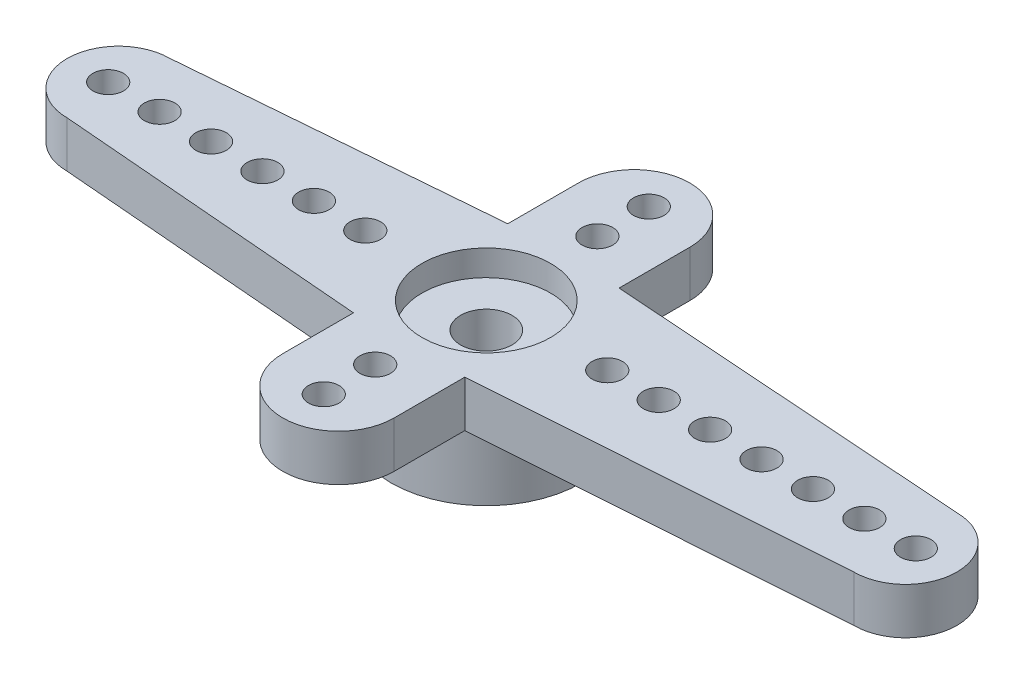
ISO-10303-21;
HEADER;
FILE_DESCRIPTION(('STEP AP214'),'2;1');
FILE_NAME('part.step','',(''),(''),'','','');
FILE_SCHEMA(('AUTOMOTIVE_DESIGN { 1 0 10303 214 1 1 1 1 }'));
ENDSEC;
DATA;
#1=APPLICATION_CONTEXT('core data for automotive mechanical design processes');
#2=APPLICATION_PROTOCOL_DEFINITION('international standard','automotive_design',2000,#1);
#3=PRODUCT_CONTEXT('',#1,'mechanical');
#4=PRODUCT('Part','Part','',(#3));
#5=PRODUCT_RELATED_PRODUCT_CATEGORY('part','',(#4));
#6=PRODUCT_DEFINITION_FORMATION('','',#4);
#7=PRODUCT_DEFINITION_CONTEXT('part definition',#1,'design');
#8=PRODUCT_DEFINITION('design','',#6,#7);
#9=PRODUCT_DEFINITION_SHAPE('','',#8);
#10=(LENGTH_UNIT() NAMED_UNIT(*) SI_UNIT(.MILLI.,.METRE.));
#11=(NAMED_UNIT(*) PLANE_ANGLE_UNIT() SI_UNIT($,.RADIAN.));
#12=(NAMED_UNIT(*) SI_UNIT($,.STERADIAN.) SOLID_ANGLE_UNIT());
#13=UNCERTAINTY_MEASURE_WITH_UNIT(LENGTH_MEASURE(1.E-05),#10,'distance_accuracy_value','');
#14=(GEOMETRIC_REPRESENTATION_CONTEXT(3) GLOBAL_UNCERTAINTY_ASSIGNED_CONTEXT((#13)) GLOBAL_UNIT_ASSIGNED_CONTEXT((#10,
#11,#12)) REPRESENTATION_CONTEXT('',''));
#15=CARTESIAN_POINT('',(0.,0.,0.));
#16=DIRECTION('',(0.,0.,1.));
#17=DIRECTION('',(1.,0.,0.));
#18=AXIS2_PLACEMENT_3D('',#15,#16,#17);
#19=CARTESIAN_POINT('',(0.,4.3,0.));
#20=DIRECTION('',(0.,-1.,0.));
#21=DIRECTION('',(0.,0.,-1.));
#22=AXIS2_PLACEMENT_3D('',#19,#20,#21);
#23=CYLINDRICAL_SURFACE('',#22,3.7);
#24=CARTESIAN_POINT('',(0.,0.,0.));
#25=DIRECTION('',(0.,1.,0.));
#26=DIRECTION('',(0.,0.,1.));
#27=AXIS2_PLACEMENT_3D('',#24,#25,#26);
#28=CIRCLE('',#27,3.7);
#29=CARTESIAN_POINT('',(0.,0.,3.7));
#30=VERTEX_POINT('',#29);
#31=EDGE_CURVE('E333',#30,#30,#28,.T.);
#32=ORIENTED_EDGE('',*,*,#31,.T.);
#33=EDGE_LOOP('',(#32));
#34=FACE_BOUND('',#33,.T.);
#35=CARTESIAN_POINT('',(0.,2.5,0.));
#36=DIRECTION('',(0.,-1.,0.));
#37=DIRECTION('',(0.,0.,-1.));
#38=AXIS2_PLACEMENT_3D('',#35,#36,#37);
#39=CIRCLE('',#38,3.7);
#40=CARTESIAN_POINT('',(2.16564,2.5,-3.00000056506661));
#41=VERTEX_POINT('',#40);
#42=CARTESIAN_POINT('',(2.16564,2.5,3.00000056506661));
#43=VERTEX_POINT('',#42);
#44=EDGE_CURVE('E341',#41,#43,#39,.T.);
#45=ORIENTED_EDGE('',*,*,#44,.T.);
#46=CARTESIAN_POINT('',(0.,2.5,0.));
#47=DIRECTION('',(0.,-1.,0.));
#48=DIRECTION('',(0.,0.,-1.));
#49=AXIS2_PLACEMENT_3D('',#46,#47,#48);
#50=CIRCLE('',#49,3.7);
#51=CARTESIAN_POINT('',(-2.16564,2.5,3.00000056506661));
#52=VERTEX_POINT('',#51);
#53=EDGE_CURVE('E11',#43,#52,#50,.T.);
#54=ORIENTED_EDGE('',*,*,#53,.T.);
#55=CARTESIAN_POINT('',(0.,2.5,0.));
#56=DIRECTION('',(0.,1.,0.));
#57=DIRECTION('',(0.,0.,1.));
#58=AXIS2_PLACEMENT_3D('',#55,#56,#57);
#59=CIRCLE('',#58,3.7);
#60=CARTESIAN_POINT('',(-2.16564,2.5,-3.00000056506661));
#61=VERTEX_POINT('',#60);
#62=EDGE_CURVE('E338',#61,#52,#59,.T.);
#63=ORIENTED_EDGE('',*,*,#62,.F.);
#64=CARTESIAN_POINT('',(0.,2.5,0.));
#65=DIRECTION('',(0.,1.,0.));
#66=DIRECTION('',(0.,0.,1.));
#67=AXIS2_PLACEMENT_3D('',#64,#65,#66);
#68=CIRCLE('',#67,3.7);
#69=EDGE_CURVE('E39',#41,#61,#68,.T.);
#70=ORIENTED_EDGE('',*,*,#69,.F.);
#71=EDGE_LOOP('',(#45,#54,#63,#70));
#72=FACE_BOUND('',#71,.T.);
#73=ADVANCED_FACE('F32',(#34,#72),#23,.T.);
#74=CARTESIAN_POINT('',(0.,4.3,0.));
#75=DIRECTION('',(0.,1.,0.));
#76=DIRECTION('',(0.,0.,1.));
#77=AXIS2_PLACEMENT_3D('',#74,#75,#76);
#78=PLANE('',#77);
#79=DIRECTION('',(0.996621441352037,0.,0.0821322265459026));
#80=VECTOR('',#79,1.);
#81=CARTESIAN_POINT('',(-2.16564,4.3,3.00000056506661));
#82=LINE('',#81,#80);
#83=CARTESIAN_POINT('',(-14.3,4.3,2.));
#84=VERTEX_POINT('',#83);
#85=CARTESIAN_POINT('',(-2.16564,4.3,3.00000056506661));
#86=VERTEX_POINT('',#85);
#87=EDGE_CURVE('E54',#84,#86,#82,.T.);
#88=ORIENTED_EDGE('',*,*,#87,.T.);
#89=DIRECTION('',(0.,0.,1.));
#90=VECTOR('',#89,1.);
#91=CARTESIAN_POINT('',(-2.16564,4.3,3.00000056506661));
#92=LINE('',#91,#90);
#93=CARTESIAN_POINT('',(-2.16564,4.3,5.75000056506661));
#94=VERTEX_POINT('',#93);
#95=EDGE_CURVE('E145',#86,#94,#92,.T.);
#96=ORIENTED_EDGE('',*,*,#95,.T.);
#97=CARTESIAN_POINT('',(0.,4.3,5.75000056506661));
#98=DIRECTION('',(0.,1.,0.));
#99=DIRECTION('',(0.,0.,-1.));
#100=AXIS2_PLACEMENT_3D('',#97,#98,#99);
#101=CIRCLE('',#100,2.16564);
#102=CARTESIAN_POINT('',(2.16564,4.3,5.75000056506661));
#103=VERTEX_POINT('',#102);
#104=EDGE_CURVE('E153',#94,#103,#101,.T.);
#105=ORIENTED_EDGE('',*,*,#104,.T.);
#106=DIRECTION('',(0.,0.,-1.));
#107=VECTOR('',#106,1.);
#108=CARTESIAN_POINT('',(2.16564,4.3,3.00000056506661));
#109=LINE('',#108,#107);
#110=CARTESIAN_POINT('',(2.16564,4.3,3.00000056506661));
#111=VERTEX_POINT('',#110);
#112=EDGE_CURVE('E127',#103,#111,#109,.T.);
#113=ORIENTED_EDGE('',*,*,#112,.T.);
#114=DIRECTION('',(0.99750660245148,0.,-0.070573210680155));
#115=VECTOR('',#114,1.);
#116=CARTESIAN_POINT('',(2.16564,4.3,3.00000056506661));
#117=LINE('',#116,#115);
#118=CARTESIAN_POINT('',(16.3,4.3,2.));
#119=VERTEX_POINT('',#118);
#120=EDGE_CURVE('E266',#111,#119,#117,.T.);
#121=ORIENTED_EDGE('',*,*,#120,.T.);
#122=CARTESIAN_POINT('',(16.3,4.3,0.));
#123=DIRECTION('',(0.,1.,0.));
#124=DIRECTION('',(0.,0.,-1.));
#125=AXIS2_PLACEMENT_3D('',#122,#123,#124);
#126=CIRCLE('',#125,2.);
#127=CARTESIAN_POINT('',(16.3,4.3,-2.));
#128=VERTEX_POINT('',#127);
#129=EDGE_CURVE('E282',#119,#128,#126,.T.);
#130=ORIENTED_EDGE('',*,*,#129,.T.);
#131=DIRECTION('',(-0.99750660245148,0.,-0.0705732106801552));
#132=VECTOR('',#131,1.);
#133=CARTESIAN_POINT('',(2.16564,4.3,-3.00000056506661));
#134=LINE('',#133,#132);
#135=CARTESIAN_POINT('',(2.16564,4.3,-3.00000056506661));
#136=VERTEX_POINT('',#135);
#137=EDGE_CURVE('E273',#128,#136,#134,.T.);
#138=ORIENTED_EDGE('',*,*,#137,.T.);
#139=DIRECTION('',(0.,0.,-1.));
#140=VECTOR('',#139,1.);
#141=CARTESIAN_POINT('',(2.16564,4.3,-3.00000056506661));
#142=LINE('',#141,#140);
#143=CARTESIAN_POINT('',(2.16564,4.3,-5.75000056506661));
#144=VERTEX_POINT('',#143);
#145=EDGE_CURVE('E46',#136,#144,#142,.T.);
#146=ORIENTED_EDGE('',*,*,#145,.T.);
#147=CARTESIAN_POINT('',(0.,4.3,-5.75000056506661));
#148=DIRECTION('',(0.,1.,0.));
#149=DIRECTION('',(0.,0.,1.));
#150=AXIS2_PLACEMENT_3D('',#147,#148,#149);
#151=CIRCLE('',#150,2.16564);
#152=CARTESIAN_POINT('',(-2.16564,4.3,-5.75000056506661));
#153=VERTEX_POINT('',#152);
#154=EDGE_CURVE('E175',#144,#153,#151,.T.);
#155=ORIENTED_EDGE('',*,*,#154,.T.);
#156=DIRECTION('',(0.,0.,1.));
#157=VECTOR('',#156,1.);
#158=CARTESIAN_POINT('',(-2.16564,4.3,-3.00000056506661));
#159=LINE('',#158,#157);
#160=CARTESIAN_POINT('',(-2.16564,4.3,-3.00000056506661));
#161=VERTEX_POINT('',#160);
#162=EDGE_CURVE('E168',#153,#161,#159,.T.);
#163=ORIENTED_EDGE('',*,*,#162,.T.);
#164=DIRECTION('',(-0.996621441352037,0.,0.0821322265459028));
#165=VECTOR('',#164,1.);
#166=CARTESIAN_POINT('',(-2.16564,4.3,-3.00000056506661));
#167=LINE('',#166,#165);
#168=CARTESIAN_POINT('',(-14.3,4.3,-2.));
#169=VERTEX_POINT('',#168);
#170=EDGE_CURVE('E289',#161,#169,#167,.T.);
#171=ORIENTED_EDGE('',*,*,#170,.T.);
#172=CARTESIAN_POINT('',(-14.3,4.3,0.));
#173=DIRECTION('',(0.,1.,0.));
#174=DIRECTION('',(0.,0.,1.));
#175=AXIS2_PLACEMENT_3D('',#172,#173,#174);
#176=CIRCLE('',#175,2.);
#177=EDGE_CURVE('E307',#169,#84,#176,.T.);
#178=ORIENTED_EDGE('',*,*,#177,.T.);
#179=EDGE_LOOP('',(#88,#96,#105,#113,#121,#130,#138,#146,#155,#163,#171,#178));
#180=FACE_BOUND('',#179,.T.);
#181=CARTESIAN_POINT('',(12.705,4.3,0.));
#182=DIRECTION('',(0.,1.,0.));
#183=DIRECTION('',(0.,0.,-1.));
#184=AXIS2_PLACEMENT_3D('',#181,#182,#183);
#185=CIRCLE('',#184,0.595);
#186=CARTESIAN_POINT('',(12.705,4.3,-0.594999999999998));
#187=VERTEX_POINT('',#186);
#188=EDGE_CURVE('E213',#187,#187,#185,.T.);
#189=ORIENTED_EDGE('',*,*,#188,.F.);
#190=EDGE_LOOP('',(#189));
#191=FACE_BOUND('',#190,.T.);
#192=CARTESIAN_POINT('',(10.705,4.3,0.));
#193=DIRECTION('',(0.,1.,0.));
#194=DIRECTION('',(0.,0.,-1.));
#195=AXIS2_PLACEMENT_3D('',#192,#193,#194);
#196=CIRCLE('',#195,0.595);
#197=CARTESIAN_POINT('',(10.705,4.3,-0.594999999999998));
#198=VERTEX_POINT('',#197);
#199=EDGE_CURVE('E219',#198,#198,#196,.T.);
#200=ORIENTED_EDGE('',*,*,#199,.F.);
#201=EDGE_LOOP('',(#200));
#202=FACE_BOUND('',#201,.T.);
#203=CARTESIAN_POINT('',(8.705,4.3,0.));
#204=DIRECTION('',(0.,1.,0.));
#205=DIRECTION('',(0.,0.,-1.));
#206=AXIS2_PLACEMENT_3D('',#203,#204,#205);
#207=CIRCLE('',#206,0.595);
#208=CARTESIAN_POINT('',(8.705,4.3,-0.594999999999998));
#209=VERTEX_POINT('',#208);
#210=EDGE_CURVE('E206',#209,#209,#207,.T.);
#211=ORIENTED_EDGE('',*,*,#210,.F.);
#212=EDGE_LOOP('',(#211));
#213=FACE_BOUND('',#212,.T.);
#214=CARTESIAN_POINT('',(16.705,4.3,0.));
#215=DIRECTION('',(0.,1.,0.));
#216=DIRECTION('',(0.,0.,-1.));
#217=AXIS2_PLACEMENT_3D('',#214,#215,#216);
#218=CIRCLE('',#217,0.594999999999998);
#219=CARTESIAN_POINT('',(16.705,4.3,-0.594999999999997));
#220=VERTEX_POINT('',#219);
#221=EDGE_CURVE('E189',#220,#220,#218,.T.);
#222=ORIENTED_EDGE('',*,*,#221,.F.);
#223=EDGE_LOOP('',(#222));
#224=FACE_BOUND('',#223,.T.);
#225=CARTESIAN_POINT('',(4.705,4.3,0.));
#226=DIRECTION('',(0.,1.,0.));
#227=DIRECTION('',(0.,0.,-1.));
#228=AXIS2_PLACEMENT_3D('',#225,#226,#227);
#229=CIRCLE('',#228,0.595);
#230=CARTESIAN_POINT('',(4.705,4.3,-0.594999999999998));
#231=VERTEX_POINT('',#230);
#232=EDGE_CURVE('E195',#231,#231,#229,.T.);
#233=ORIENTED_EDGE('',*,*,#232,.F.);
#234=EDGE_LOOP('',(#233));
#235=FACE_BOUND('',#234,.T.);
#236=CARTESIAN_POINT('',(6.705,4.3,0.));
#237=DIRECTION('',(0.,1.,0.));
#238=DIRECTION('',(0.,0.,-1.));
#239=AXIS2_PLACEMENT_3D('',#236,#237,#238);
#240=CIRCLE('',#239,0.595);
#241=CARTESIAN_POINT('',(6.705,4.3,-0.594999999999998));
#242=VERTEX_POINT('',#241);
#243=EDGE_CURVE('E194',#242,#242,#240,.T.);
#244=ORIENTED_EDGE('',*,*,#243,.F.);
#245=EDGE_LOOP('',(#244));
#246=FACE_BOUND('',#245,.T.);
#247=CARTESIAN_POINT('',(14.705,4.3,0.));
#248=DIRECTION('',(0.,1.,0.));
#249=DIRECTION('',(0.,0.,-1.));
#250=AXIS2_PLACEMENT_3D('',#247,#248,#249);
#251=CIRCLE('',#250,0.595);
#252=CARTESIAN_POINT('',(14.705,4.3,-0.594999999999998));
#253=VERTEX_POINT('',#252);
#254=EDGE_CURVE('E212',#253,#253,#251,.T.);
#255=ORIENTED_EDGE('',*,*,#254,.F.);
#256=EDGE_LOOP('',(#255));
#257=FACE_BOUND('',#256,.T.);
#258=CARTESIAN_POINT('',(-4.705,4.3,0.));
#259=DIRECTION('',(0.,1.,0.));
#260=DIRECTION('',(0.,0.,1.));
#261=AXIS2_PLACEMENT_3D('',#258,#259,#260);
#262=CIRCLE('',#261,0.595);
#263=CARTESIAN_POINT('',(-4.705,4.3,0.595000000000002));
#264=VERTEX_POINT('',#263);
#265=EDGE_CURVE('E255',#264,#264,#262,.T.);
#266=ORIENTED_EDGE('',*,*,#265,.F.);
#267=EDGE_LOOP('',(#266));
#268=FACE_BOUND('',#267,.T.);
#269=CARTESIAN_POINT('',(-6.705,4.3,0.));
#270=DIRECTION('',(0.,1.,0.));
#271=DIRECTION('',(0.,0.,1.));
#272=AXIS2_PLACEMENT_3D('',#269,#270,#271);
#273=CIRCLE('',#272,0.595);
#274=CARTESIAN_POINT('',(-6.705,4.3,0.595000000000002));
#275=VERTEX_POINT('',#274);
#276=EDGE_CURVE('E249',#275,#275,#273,.T.);
#277=ORIENTED_EDGE('',*,*,#276,.F.);
#278=EDGE_LOOP('',(#277));
#279=FACE_BOUND('',#278,.T.);
#280=CARTESIAN_POINT('',(-8.705,4.3,0.));
#281=DIRECTION('',(0.,1.,0.));
#282=DIRECTION('',(0.,0.,1.));
#283=AXIS2_PLACEMENT_3D('',#280,#281,#282);
#284=CIRCLE('',#283,0.595);
#285=CARTESIAN_POINT('',(-8.705,4.3,0.595000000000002));
#286=VERTEX_POINT('',#285);
#287=EDGE_CURVE('E243',#286,#286,#284,.T.);
#288=ORIENTED_EDGE('',*,*,#287,.F.);
#289=EDGE_LOOP('',(#288));
#290=FACE_BOUND('',#289,.T.);
#291=CARTESIAN_POINT('',(-10.705,4.3,0.));
#292=DIRECTION('',(0.,1.,0.));
#293=DIRECTION('',(0.,0.,1.));
#294=AXIS2_PLACEMENT_3D('',#291,#292,#293);
#295=CIRCLE('',#294,0.595);
#296=CARTESIAN_POINT('',(-10.705,4.3,0.595000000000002));
#297=VERTEX_POINT('',#296);
#298=EDGE_CURVE('E237',#297,#297,#295,.T.);
#299=ORIENTED_EDGE('',*,*,#298,.F.);
#300=EDGE_LOOP('',(#299));
#301=FACE_BOUND('',#300,.T.);
#302=CARTESIAN_POINT('',(-12.705,4.3,0.));
#303=DIRECTION('',(0.,1.,0.));
#304=DIRECTION('',(0.,0.,1.));
#305=AXIS2_PLACEMENT_3D('',#302,#303,#304);
#306=CIRCLE('',#305,0.595);
#307=CARTESIAN_POINT('',(-12.705,4.3,0.595000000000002));
#308=VERTEX_POINT('',#307);
#309=EDGE_CURVE('E231',#308,#308,#306,.T.);
#310=ORIENTED_EDGE('',*,*,#309,.F.);
#311=EDGE_LOOP('',(#310));
#312=FACE_BOUND('',#311,.T.);
#313=CARTESIAN_POINT('',(-14.705,4.3,0.));
#314=DIRECTION('',(0.,1.,0.));
#315=DIRECTION('',(0.,0.,1.));
#316=AXIS2_PLACEMENT_3D('',#313,#314,#315);
#317=CIRCLE('',#316,0.595);
#318=CARTESIAN_POINT('',(-14.705,4.3,0.595000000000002));
#319=VERTEX_POINT('',#318);
#320=EDGE_CURVE('E230',#319,#319,#317,.T.);
#321=ORIENTED_EDGE('',*,*,#320,.F.);
#322=EDGE_LOOP('',(#321));
#323=FACE_BOUND('',#322,.T.);
#324=CARTESIAN_POINT('',(0.,4.3,0.));
#325=DIRECTION('',(0.,1.,0.));
#326=DIRECTION('',(0.,0.,1.));
#327=AXIS2_PLACEMENT_3D('',#324,#325,#326);
#328=CIRCLE('',#327,2.5);
#329=CARTESIAN_POINT('',(0.,4.3,2.5));
#330=VERTEX_POINT('',#329);
#331=EDGE_CURVE('E321',#330,#330,#328,.T.);
#332=ORIENTED_EDGE('',*,*,#331,.F.);
#333=EDGE_LOOP('',(#332));
#334=FACE_BOUND('',#333,.T.);
#335=CARTESIAN_POINT('',(0.,4.3,-4.32064056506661));
#336=DIRECTION('',(0.,1.,0.));
#337=DIRECTION('',(0.,0.,1.));
#338=AXIS2_PLACEMENT_3D('',#335,#336,#337);
#339=CIRCLE('',#338,0.595);
#340=CARTESIAN_POINT('',(0.,4.3,-3.72564056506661));
#341=VERTEX_POINT('',#340);
#342=EDGE_CURVE('E157',#341,#341,#339,.T.);
#343=ORIENTED_EDGE('',*,*,#342,.F.);
#344=EDGE_LOOP('',(#343));
#345=FACE_BOUND('',#344,.T.);
#346=CARTESIAN_POINT('',(0.,4.3,-6.32064056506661));
#347=DIRECTION('',(0.,1.,0.));
#348=DIRECTION('',(0.,0.,1.));
#349=AXIS2_PLACEMENT_3D('',#346,#347,#348);
#350=CIRCLE('',#349,0.595);
#351=CARTESIAN_POINT('',(0.,4.3,-5.72564056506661));
#352=VERTEX_POINT('',#351);
#353=EDGE_CURVE('E162',#352,#352,#350,.T.);
#354=ORIENTED_EDGE('',*,*,#353,.F.);
#355=EDGE_LOOP('',(#354));
#356=FACE_BOUND('',#355,.T.);
#357=CARTESIAN_POINT('',(0.,4.3,6.32064056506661));
#358=DIRECTION('',(0.,1.,0.));
#359=DIRECTION('',(0.,0.,-1.));
#360=AXIS2_PLACEMENT_3D('',#357,#358,#359);
#361=CIRCLE('',#360,0.595);
#362=CARTESIAN_POINT('',(0.,4.3,5.72564056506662));
#363=VERTEX_POINT('',#362);
#364=EDGE_CURVE('E608',#363,#363,#361,.T.);
#365=ORIENTED_EDGE('',*,*,#364,.F.);
#366=EDGE_LOOP('',(#365));
#367=FACE_BOUND('',#366,.T.);
#368=CARTESIAN_POINT('',(0.,4.3,4.32064056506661));
#369=DIRECTION('',(0.,1.,0.));
#370=DIRECTION('',(0.,0.,-1.));
#371=AXIS2_PLACEMENT_3D('',#368,#369,#370);
#372=CIRCLE('',#371,0.595);
#373=CARTESIAN_POINT('',(0.,4.3,3.72564056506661));
#374=VERTEX_POINT('',#373);
#375=EDGE_CURVE('E149',#374,#374,#372,.T.);
#376=ORIENTED_EDGE('',*,*,#375,.F.);
#377=EDGE_LOOP('',(#376));
#378=FACE_BOUND('',#377,.T.);
#379=ADVANCED_FACE('F377',(#180,#191,#202,#213,#224,#235,#246,#257,#268,#279,#290,#301,#312,
#323,#334,#345,#356,#367,#378),#78,.T.);
#380=CARTESIAN_POINT('',(0.,0.,0.));
#381=DIRECTION('',(0.,1.,0.));
#382=DIRECTION('',(0.,0.,1.));
#383=AXIS2_PLACEMENT_3D('',#380,#381,#382);
#384=PLANE('',#383);
#385=CARTESIAN_POINT('',(0.,0.,0.));
#386=DIRECTION('',(0.,-1.,0.));
#387=DIRECTION('',(0.,0.,-1.));
#388=AXIS2_PLACEMENT_3D('',#385,#386,#387);
#389=CIRCLE('',#388,2.5);
#390=CARTESIAN_POINT('',(0.,0.,-2.5));
#391=VERTEX_POINT('',#390);
#392=EDGE_CURVE('E327',#391,#391,#389,.T.);
#393=ORIENTED_EDGE('',*,*,#392,.F.);
#394=EDGE_LOOP('',(#393));
#395=FACE_BOUND('',#394,.T.);
#396=ORIENTED_EDGE('',*,*,#31,.F.);
#397=EDGE_LOOP('',(#396));
#398=FACE_BOUND('',#397,.T.);
#399=ADVANCED_FACE('F408',(#395,#398),#384,.F.);
#400=CARTESIAN_POINT('',(0.,1.5,0.));
#401=DIRECTION('',(0.,-1.,0.));
#402=DIRECTION('',(0.,0.,-1.));
#403=AXIS2_PLACEMENT_3D('',#400,#401,#402);
#404=CYLINDRICAL_SURFACE('',#403,2.5);
#405=CARTESIAN_POINT('',(0.,1.5,0.));
#406=DIRECTION('',(0.,-1.,0.));
#407=DIRECTION('',(0.,0.,-1.));
#408=AXIS2_PLACEMENT_3D('',#405,#406,#407);
#409=CIRCLE('',#408,2.5);
#410=CARTESIAN_POINT('',(0.,1.5,-2.5));
#411=VERTEX_POINT('',#410);
#412=EDGE_CURVE('E330',#411,#411,#409,.T.);
#413=ORIENTED_EDGE('',*,*,#412,.F.);
#414=EDGE_LOOP('',(#413));
#415=FACE_BOUND('',#414,.T.);
#416=ORIENTED_EDGE('',*,*,#392,.T.);
#417=EDGE_LOOP('',(#416));
#418=FACE_BOUND('',#417,.T.);
#419=ADVANCED_FACE('F413',(#415,#418),#404,.F.);
#420=CARTESIAN_POINT('',(0.,1.5,0.));
#421=DIRECTION('',(0.,-1.,0.));
#422=DIRECTION('',(0.,0.,-1.));
#423=AXIS2_PLACEMENT_3D('',#420,#421,#422);
#424=PLANE('',#423);
#425=CARTESIAN_POINT('',(0.,1.5,0.));
#426=DIRECTION('',(0.,1.,0.));
#427=DIRECTION('',(0.,0.,1.));
#428=AXIS2_PLACEMENT_3D('',#425,#426,#427);
#429=CIRCLE('',#428,1.);
#430=CARTESIAN_POINT('',(0.,1.5,1.));
#431=VERTEX_POINT('',#430);
#432=EDGE_CURVE('E318',#431,#431,#429,.T.);
#433=ORIENTED_EDGE('',*,*,#432,.T.);
#434=EDGE_LOOP('',(#433));
#435=FACE_BOUND('',#434,.T.);
#436=ORIENTED_EDGE('',*,*,#412,.T.);
#437=EDGE_LOOP('',(#436));
#438=FACE_BOUND('',#437,.T.);
#439=ADVANCED_FACE('F418',(#435,#438),#424,.T.);
#440=CARTESIAN_POINT('',(0.,3.3,0.));
#441=DIRECTION('',(0.,1.,0.));
#442=DIRECTION('',(0.,0.,1.));
#443=AXIS2_PLACEMENT_3D('',#440,#441,#442);
#444=CYLINDRICAL_SURFACE('',#443,2.5);
#445=CARTESIAN_POINT('',(0.,3.3,0.));
#446=DIRECTION('',(0.,1.,0.));
#447=DIRECTION('',(0.,0.,1.));
#448=AXIS2_PLACEMENT_3D('',#445,#446,#447);
#449=CIRCLE('',#448,2.5);
#450=CARTESIAN_POINT('',(0.,3.3,2.5));
#451=VERTEX_POINT('',#450);
#452=EDGE_CURVE('E324',#451,#451,#449,.T.);
#453=ORIENTED_EDGE('',*,*,#452,.F.);
#454=EDGE_LOOP('',(#453));
#455=FACE_BOUND('',#454,.T.);
#456=ORIENTED_EDGE('',*,*,#331,.T.);
#457=EDGE_LOOP('',(#456));
#458=FACE_BOUND('',#457,.T.);
#459=ADVANCED_FACE('F425',(#455,#458),#444,.F.);
#460=CARTESIAN_POINT('',(0.,3.3,0.));
#461=DIRECTION('',(0.,1.,0.));
#462=DIRECTION('',(0.,0.,1.));
#463=AXIS2_PLACEMENT_3D('',#460,#461,#462);
#464=PLANE('',#463);
#465=CARTESIAN_POINT('',(0.,3.3,0.));
#466=DIRECTION('',(0.,1.,0.));
#467=DIRECTION('',(0.,0.,1.));
#468=AXIS2_PLACEMENT_3D('',#465,#466,#467);
#469=CIRCLE('',#468,1.);
#470=CARTESIAN_POINT('',(0.,3.3,1.));
#471=VERTEX_POINT('',#470);
#472=EDGE_CURVE('E312',#471,#471,#469,.T.);
#473=ORIENTED_EDGE('',*,*,#472,.F.);
#474=EDGE_LOOP('',(#473));
#475=FACE_BOUND('',#474,.T.);
#476=ORIENTED_EDGE('',*,*,#452,.T.);
#477=EDGE_LOOP('',(#476));
#478=FACE_BOUND('',#477,.T.);
#479=ADVANCED_FACE('F429',(#475,#478),#464,.T.);
#480=CARTESIAN_POINT('',(0.,1.5,0.));
#481=DIRECTION('',(0.,1.,0.));
#482=DIRECTION('',(0.,0.,1.));
#483=AXIS2_PLACEMENT_3D('',#480,#481,#482);
#484=CYLINDRICAL_SURFACE('',#483,1.);
#485=ORIENTED_EDGE('',*,*,#432,.F.);
#486=EDGE_LOOP('',(#485));
#487=FACE_BOUND('',#486,.T.);
#488=ORIENTED_EDGE('',*,*,#472,.T.);
#489=EDGE_LOOP('',(#488));
#490=FACE_BOUND('',#489,.T.);
#491=ADVANCED_FACE('F433',(#487,#490),#484,.F.);
#492=CARTESIAN_POINT('',(-2.16564,2.5,-3.00000056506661));
#493=DIRECTION('',(-0.0821322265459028,0.,-0.996621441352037));
#494=DIRECTION('',(-0.996621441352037,0.,0.0821322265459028));
#495=AXIS2_PLACEMENT_3D('',#492,#493,#494);
#496=PLANE('',#495);
#497=ORIENTED_EDGE('',*,*,#170,.F.);
#498=DIRECTION('',(0.,1.,0.));
#499=VECTOR('',#498,1.);
#500=CARTESIAN_POINT('',(-2.16564,2.5,-3.00000056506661));
#501=LINE('',#500,#499);
#502=EDGE_CURVE('E310',#61,#161,#501,.T.);
#503=ORIENTED_EDGE('',*,*,#502,.F.);
#504=DIRECTION('',(-0.996621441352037,0.,0.0821322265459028));
#505=VECTOR('',#504,1.);
#506=CARTESIAN_POINT('',(-2.16564,2.5,-3.00000056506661));
#507=LINE('',#506,#505);
#508=CARTESIAN_POINT('',(-14.3,2.5,-2.));
#509=VERTEX_POINT('',#508);
#510=EDGE_CURVE('E295',#61,#509,#507,.T.);
#511=ORIENTED_EDGE('',*,*,#510,.T.);
#512=DIRECTION('',(0.,1.,0.));
#513=VECTOR('',#512,1.);
#514=CARTESIAN_POINT('',(-14.3,2.5,-2.));
#515=LINE('',#514,#513);
#516=EDGE_CURVE('E304',#509,#169,#515,.T.);
#517=ORIENTED_EDGE('',*,*,#516,.T.);
#518=EDGE_LOOP('',(#497,#503,#511,#517));
#519=FACE_BOUND('',#518,.T.);
#520=ADVANCED_FACE('F359',(#519),#496,.T.);
#521=CARTESIAN_POINT('',(-2.16564,2.5,3.00000056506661));
#522=DIRECTION('',(-0.0821322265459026,0.,0.996621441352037));
#523=DIRECTION('',(0.996621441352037,0.,0.0821322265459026));
#524=AXIS2_PLACEMENT_3D('',#521,#522,#523);
#525=PLANE('',#524);
#526=ORIENTED_EDGE('',*,*,#87,.F.);
#527=DIRECTION('',(0.,1.,0.));
#528=VECTOR('',#527,1.);
#529=CARTESIAN_POINT('',(-14.3,2.5,2.));
#530=LINE('',#529,#528);
#531=CARTESIAN_POINT('',(-14.3,2.5,2.));
#532=VERTEX_POINT('',#531);
#533=EDGE_CURVE('E315',#532,#84,#530,.T.);
#534=ORIENTED_EDGE('',*,*,#533,.F.);
#535=DIRECTION('',(0.996621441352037,0.,0.0821322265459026));
#536=VECTOR('',#535,1.);
#537=CARTESIAN_POINT('',(-2.16564,2.5,3.00000056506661));
#538=LINE('',#537,#536);
#539=EDGE_CURVE('E301',#532,#52,#538,.T.);
#540=ORIENTED_EDGE('',*,*,#539,.T.);
#541=DIRECTION('',(0.,1.,0.));
#542=VECTOR('',#541,1.);
#543=CARTESIAN_POINT('',(-2.16564,2.5,3.00000056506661));
#544=LINE('',#543,#542);
#545=EDGE_CURVE('E313',#52,#86,#544,.T.);
#546=ORIENTED_EDGE('',*,*,#545,.T.);
#547=EDGE_LOOP('',(#526,#534,#540,#546));
#548=FACE_BOUND('',#547,.T.);
#549=ADVANCED_FACE('F384',(#548),#525,.T.);
#550=CARTESIAN_POINT('',(-14.3,2.5,0.));
#551=DIRECTION('',(0.,1.,0.));
#552=DIRECTION('',(0.,0.,1.));
#553=AXIS2_PLACEMENT_3D('',#550,#551,#552);
#554=CYLINDRICAL_SURFACE('',#553,2.);
#555=ORIENTED_EDGE('',*,*,#177,.F.);
#556=ORIENTED_EDGE('',*,*,#516,.F.);
#557=CARTESIAN_POINT('',(-14.3,2.5,0.));
#558=DIRECTION('',(0.,1.,0.));
#559=DIRECTION('',(0.,0.,1.));
#560=AXIS2_PLACEMENT_3D('',#557,#558,#559);
#561=CIRCLE('',#560,2.);
#562=EDGE_CURVE('E298',#509,#532,#561,.T.);
#563=ORIENTED_EDGE('',*,*,#562,.T.);
#564=ORIENTED_EDGE('',*,*,#533,.T.);
#565=EDGE_LOOP('',(#555,#556,#563,#564));
#566=FACE_BOUND('',#565,.T.);
#567=ADVANCED_FACE('F387',(#566),#554,.T.);
#568=CARTESIAN_POINT('',(-14.3,2.5,0.));
#569=DIRECTION('',(0.,1.,0.));
#570=DIRECTION('',(0.,0.,1.));
#571=AXIS2_PLACEMENT_3D('',#568,#569,#570);
#572=PLANE('',#571);
#573=CARTESIAN_POINT('',(-4.705,2.5,0.));
#574=DIRECTION('',(0.,1.,0.));
#575=DIRECTION('',(0.,0.,1.));
#576=AXIS2_PLACEMENT_3D('',#573,#574,#575);
#577=CIRCLE('',#576,0.595);
#578=CARTESIAN_POINT('',(-4.705,2.5,0.595000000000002));
#579=VERTEX_POINT('',#578);
#580=EDGE_CURVE('E252',#579,#579,#577,.T.);
#581=ORIENTED_EDGE('',*,*,#580,.T.);
#582=EDGE_LOOP('',(#581));
#583=FACE_BOUND('',#582,.T.);
#584=CARTESIAN_POINT('',(-6.705,2.5,0.));
#585=DIRECTION('',(0.,1.,0.));
#586=DIRECTION('',(0.,0.,1.));
#587=AXIS2_PLACEMENT_3D('',#584,#585,#586);
#588=CIRCLE('',#587,0.595);
#589=CARTESIAN_POINT('',(-6.705,2.5,0.595000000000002));
#590=VERTEX_POINT('',#589);
#591=EDGE_CURVE('E246',#590,#590,#588,.T.);
#592=ORIENTED_EDGE('',*,*,#591,.T.);
#593=EDGE_LOOP('',(#592));
#594=FACE_BOUND('',#593,.T.);
#595=CARTESIAN_POINT('',(-8.705,2.5,0.));
#596=DIRECTION('',(0.,1.,0.));
#597=DIRECTION('',(0.,0.,1.));
#598=AXIS2_PLACEMENT_3D('',#595,#596,#597);
#599=CIRCLE('',#598,0.595);
#600=CARTESIAN_POINT('',(-8.705,2.5,0.595000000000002));
#601=VERTEX_POINT('',#600);
#602=EDGE_CURVE('E240',#601,#601,#599,.T.);
#603=ORIENTED_EDGE('',*,*,#602,.T.);
#604=EDGE_LOOP('',(#603));
#605=FACE_BOUND('',#604,.T.);
#606=CARTESIAN_POINT('',(-10.705,2.5,0.));
#607=DIRECTION('',(0.,1.,0.));
#608=DIRECTION('',(0.,0.,1.));
#609=AXIS2_PLACEMENT_3D('',#606,#607,#608);
#610=CIRCLE('',#609,0.595);
#611=CARTESIAN_POINT('',(-10.705,2.5,0.595000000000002));
#612=VERTEX_POINT('',#611);
#613=EDGE_CURVE('E234',#612,#612,#610,.T.);
#614=ORIENTED_EDGE('',*,*,#613,.T.);
#615=EDGE_LOOP('',(#614));
#616=FACE_BOUND('',#615,.T.);
#617=CARTESIAN_POINT('',(-12.705,2.5,0.));
#618=DIRECTION('',(0.,1.,0.));
#619=DIRECTION('',(0.,0.,1.));
#620=AXIS2_PLACEMENT_3D('',#617,#618,#619);
#621=CIRCLE('',#620,0.595);
#622=CARTESIAN_POINT('',(-12.705,2.5,0.595000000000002));
#623=VERTEX_POINT('',#622);
#624=EDGE_CURVE('E227',#623,#623,#621,.T.);
#625=ORIENTED_EDGE('',*,*,#624,.T.);
#626=EDGE_LOOP('',(#625));
#627=FACE_BOUND('',#626,.T.);
#628=CARTESIAN_POINT('',(-14.705,2.5,0.));
#629=DIRECTION('',(0.,1.,0.));
#630=DIRECTION('',(0.,0.,1.));
#631=AXIS2_PLACEMENT_3D('',#628,#629,#630);
#632=CIRCLE('',#631,0.595);
#633=CARTESIAN_POINT('',(-14.705,2.5,0.595000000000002));
#634=VERTEX_POINT('',#633);
#635=EDGE_CURVE('E263',#634,#634,#632,.T.);
#636=ORIENTED_EDGE('',*,*,#635,.T.);
#637=EDGE_LOOP('',(#636));
#638=FACE_BOUND('',#637,.T.);
#639=ORIENTED_EDGE('',*,*,#510,.F.);
#640=ORIENTED_EDGE('',*,*,#62,.T.);
#641=ORIENTED_EDGE('',*,*,#539,.F.);
#642=ORIENTED_EDGE('',*,*,#562,.F.);
#643=EDGE_LOOP('',(#639,#640,#641,#642));
#644=FACE_BOUND('',#643,.T.);
#645=ADVANCED_FACE('F362',(#583,#594,#605,#616,#627,#638,#644),#572,.F.);
#646=CARTESIAN_POINT('',(2.16564,2.5,-3.00000056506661));
#647=DIRECTION('',(0.0705732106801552,0.,-0.99750660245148));
#648=DIRECTION('',(-0.99750660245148,0.,-0.0705732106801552));
#649=AXIS2_PLACEMENT_3D('',#646,#647,#648);
#650=PLANE('',#649);
#651=ORIENTED_EDGE('',*,*,#137,.F.);
#652=DIRECTION('',(0.,1.,0.));
#653=VECTOR('',#652,1.);
#654=CARTESIAN_POINT('',(16.3,2.5,-2.));
#655=LINE('',#654,#653);
#656=CARTESIAN_POINT('',(16.3,2.5,-2.));
#657=VERTEX_POINT('',#656);
#658=EDGE_CURVE('E290',#657,#128,#655,.T.);
#659=ORIENTED_EDGE('',*,*,#658,.F.);
#660=DIRECTION('',(-0.99750660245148,0.,-0.0705732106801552));
#661=VECTOR('',#660,1.);
#662=CARTESIAN_POINT('',(2.16564,2.5,-3.00000056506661));
#663=LINE('',#662,#661);
#664=EDGE_CURVE('E276',#657,#41,#663,.T.);
#665=ORIENTED_EDGE('',*,*,#664,.T.);
#666=DIRECTION('',(0.,1.,0.));
#667=VECTOR('',#666,1.);
#668=CARTESIAN_POINT('',(2.16564,2.5,-3.00000056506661));
#669=LINE('',#668,#667);
#670=EDGE_CURVE('E286',#41,#136,#669,.T.);
#671=ORIENTED_EDGE('',*,*,#670,.T.);
#672=EDGE_LOOP('',(#651,#659,#665,#671));
#673=FACE_BOUND('',#672,.T.);
#674=ADVANCED_FACE('F371',(#673),#650,.T.);
#675=CARTESIAN_POINT('',(16.3,2.5,0.));
#676=DIRECTION('',(0.,1.,0.));
#677=DIRECTION('',(0.,0.,1.));
#678=AXIS2_PLACEMENT_3D('',#675,#676,#677);
#679=CYLINDRICAL_SURFACE('',#678,2.);
#680=ORIENTED_EDGE('',*,*,#129,.F.);
#681=DIRECTION('',(0.,1.,0.));
#682=VECTOR('',#681,1.);
#683=CARTESIAN_POINT('',(16.3,2.5,2.));
#684=LINE('',#683,#682);
#685=CARTESIAN_POINT('',(16.3,2.5,2.));
#686=VERTEX_POINT('',#685);
#687=EDGE_CURVE('E292',#686,#119,#684,.T.);
#688=ORIENTED_EDGE('',*,*,#687,.F.);
#689=CARTESIAN_POINT('',(16.3,2.5,0.));
#690=DIRECTION('',(0.,1.,0.));
#691=DIRECTION('',(0.,0.,-1.));
#692=AXIS2_PLACEMENT_3D('',#689,#690,#691);
#693=CIRCLE('',#692,2.);
#694=EDGE_CURVE('E272',#686,#657,#693,.T.);
#695=ORIENTED_EDGE('',*,*,#694,.T.);
#696=ORIENTED_EDGE('',*,*,#658,.T.);
#697=EDGE_LOOP('',(#680,#688,#695,#696));
#698=FACE_BOUND('',#697,.T.);
#699=ADVANCED_FACE('F374',(#698),#679,.T.);
#700=CARTESIAN_POINT('',(2.16564,2.5,3.00000056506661));
#701=DIRECTION('',(0.070573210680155,0.,0.99750660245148));
#702=DIRECTION('',(0.99750660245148,0.,-0.070573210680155));
#703=AXIS2_PLACEMENT_3D('',#700,#701,#702);
#704=PLANE('',#703);
#705=ORIENTED_EDGE('',*,*,#120,.F.);
#706=DIRECTION('',(0.,1.,0.));
#707=VECTOR('',#706,1.);
#708=CARTESIAN_POINT('',(2.16564,2.5,3.00000056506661));
#709=LINE('',#708,#707);
#710=EDGE_CURVE('E279',#43,#111,#709,.T.);
#711=ORIENTED_EDGE('',*,*,#710,.F.);
#712=DIRECTION('',(0.99750660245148,0.,-0.070573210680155));
#713=VECTOR('',#712,1.);
#714=CARTESIAN_POINT('',(2.16564,2.5,3.00000056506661));
#715=LINE('',#714,#713);
#716=EDGE_CURVE('E269',#43,#686,#715,.T.);
#717=ORIENTED_EDGE('',*,*,#716,.T.);
#718=ORIENTED_EDGE('',*,*,#687,.T.);
#719=EDGE_LOOP('',(#705,#711,#717,#718));
#720=FACE_BOUND('',#719,.T.);
#721=ADVANCED_FACE('F376',(#720),#704,.T.);
#722=CARTESIAN_POINT('',(16.3,2.5,0.));
#723=DIRECTION('',(0.,-1.,0.));
#724=DIRECTION('',(0.,0.,-1.));
#725=AXIS2_PLACEMENT_3D('',#722,#723,#724);
#726=PLANE('',#725);
#727=CARTESIAN_POINT('',(12.705,2.5,0.));
#728=DIRECTION('',(0.,1.,0.));
#729=DIRECTION('',(0.,0.,-1.));
#730=AXIS2_PLACEMENT_3D('',#727,#728,#729);
#731=CIRCLE('',#730,0.595);
#732=CARTESIAN_POINT('',(12.705,2.5,-0.594999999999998));
#733=VERTEX_POINT('',#732);
#734=EDGE_CURVE('E209',#733,#733,#731,.T.);
#735=ORIENTED_EDGE('',*,*,#734,.T.);
#736=EDGE_LOOP('',(#735));
#737=FACE_BOUND('',#736,.T.);
#738=CARTESIAN_POINT('',(10.705,2.5,0.));
#739=DIRECTION('',(0.,1.,0.));
#740=DIRECTION('',(0.,0.,-1.));
#741=AXIS2_PLACEMENT_3D('',#738,#739,#740);
#742=CIRCLE('',#741,0.595);
#743=CARTESIAN_POINT('',(10.705,2.5,-0.594999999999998));
#744=VERTEX_POINT('',#743);
#745=EDGE_CURVE('E216',#744,#744,#742,.T.);
#746=ORIENTED_EDGE('',*,*,#745,.T.);
#747=EDGE_LOOP('',(#746));
#748=FACE_BOUND('',#747,.T.);
#749=CARTESIAN_POINT('',(8.705,2.5,0.));
#750=DIRECTION('',(0.,1.,0.));
#751=DIRECTION('',(0.,0.,-1.));
#752=AXIS2_PLACEMENT_3D('',#749,#750,#751);
#753=CIRCLE('',#752,0.595);
#754=CARTESIAN_POINT('',(8.705,2.5,-0.594999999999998));
#755=VERTEX_POINT('',#754);
#756=EDGE_CURVE('E222',#755,#755,#753,.T.);
#757=ORIENTED_EDGE('',*,*,#756,.T.);
#758=EDGE_LOOP('',(#757));
#759=FACE_BOUND('',#758,.T.);
#760=CARTESIAN_POINT('',(16.705,2.5,0.));
#761=DIRECTION('',(0.,1.,0.));
#762=DIRECTION('',(0.,0.,-1.));
#763=AXIS2_PLACEMENT_3D('',#760,#761,#762);
#764=CIRCLE('',#763,0.594999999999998);
#765=CARTESIAN_POINT('',(16.705,2.5,-0.594999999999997));
#766=VERTEX_POINT('',#765);
#767=EDGE_CURVE('E198',#766,#766,#764,.T.);
#768=ORIENTED_EDGE('',*,*,#767,.T.);
#769=EDGE_LOOP('',(#768));
#770=FACE_BOUND('',#769,.T.);
#771=CARTESIAN_POINT('',(4.705,2.5,0.));
#772=DIRECTION('',(0.,1.,0.));
#773=DIRECTION('',(0.,0.,-1.));
#774=AXIS2_PLACEMENT_3D('',#771,#772,#773);
#775=CIRCLE('',#774,0.595);
#776=CARTESIAN_POINT('',(4.705,2.5,-0.594999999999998));
#777=VERTEX_POINT('',#776);
#778=EDGE_CURVE('E191',#777,#777,#775,.T.);
#779=ORIENTED_EDGE('',*,*,#778,.T.);
#780=EDGE_LOOP('',(#779));
#781=FACE_BOUND('',#780,.T.);
#782=CARTESIAN_POINT('',(6.705,2.5,0.));
#783=DIRECTION('',(0.,1.,0.));
#784=DIRECTION('',(0.,0.,-1.));
#785=AXIS2_PLACEMENT_3D('',#782,#783,#784);
#786=CIRCLE('',#785,0.595);
#787=CARTESIAN_POINT('',(6.705,2.5,-0.594999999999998));
#788=VERTEX_POINT('',#787);
#789=EDGE_CURVE('E203',#788,#788,#786,.T.);
#790=ORIENTED_EDGE('',*,*,#789,.T.);
#791=EDGE_LOOP('',(#790));
#792=FACE_BOUND('',#791,.T.);
#793=CARTESIAN_POINT('',(14.705,2.5,0.));
#794=DIRECTION('',(0.,1.,0.));
#795=DIRECTION('',(0.,0.,-1.));
#796=AXIS2_PLACEMENT_3D('',#793,#794,#795);
#797=CIRCLE('',#796,0.595);
#798=CARTESIAN_POINT('',(14.705,2.5,-0.594999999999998));
#799=VERTEX_POINT('',#798);
#800=EDGE_CURVE('E258',#799,#799,#797,.T.);
#801=ORIENTED_EDGE('',*,*,#800,.T.);
#802=EDGE_LOOP('',(#801));
#803=FACE_BOUND('',#802,.T.);
#804=ORIENTED_EDGE('',*,*,#44,.F.);
#805=ORIENTED_EDGE('',*,*,#664,.F.);
#806=ORIENTED_EDGE('',*,*,#694,.F.);
#807=ORIENTED_EDGE('',*,*,#716,.F.);
#808=EDGE_LOOP('',(#804,#805,#806,#807));
#809=FACE_BOUND('',#808,.T.);
#810=ADVANCED_FACE('F367',(#737,#748,#759,#770,#781,#792,#803,#809),#726,.T.);
#811=CARTESIAN_POINT('',(-14.705,2.5,0.));
#812=DIRECTION('',(0.,1.,0.));
#813=DIRECTION('',(0.,0.,1.));
#814=AXIS2_PLACEMENT_3D('',#811,#812,#813);
#815=CYLINDRICAL_SURFACE('',#814,0.595);
#816=ORIENTED_EDGE('',*,*,#635,.F.);
#817=EDGE_LOOP('',(#816));
#818=FACE_BOUND('',#817,.T.);
#819=ORIENTED_EDGE('',*,*,#320,.T.);
#820=EDGE_LOOP('',(#819));
#821=FACE_BOUND('',#820,.T.);
#822=ADVANCED_FACE('F455',(#818,#821),#815,.F.);
#823=CARTESIAN_POINT('',(14.705,2.5,0.));
#824=DIRECTION('',(0.,1.,0.));
#825=DIRECTION('',(0.,0.,1.));
#826=AXIS2_PLACEMENT_3D('',#823,#824,#825);
#827=CYLINDRICAL_SURFACE('',#826,0.595);
#828=ORIENTED_EDGE('',*,*,#800,.F.);
#829=EDGE_LOOP('',(#828));
#830=FACE_BOUND('',#829,.T.);
#831=ORIENTED_EDGE('',*,*,#254,.T.);
#832=EDGE_LOOP('',(#831));
#833=FACE_BOUND('',#832,.T.);
#834=ADVANCED_FACE('F459',(#830,#833),#827,.F.);
#835=CARTESIAN_POINT('',(6.705,2.5,0.));
#836=DIRECTION('',(0.,1.,0.));
#837=DIRECTION('',(0.,0.,1.));
#838=AXIS2_PLACEMENT_3D('',#835,#836,#837);
#839=CYLINDRICAL_SURFACE('',#838,0.595);
#840=ORIENTED_EDGE('',*,*,#789,.F.);
#841=EDGE_LOOP('',(#840));
#842=FACE_BOUND('',#841,.T.);
#843=ORIENTED_EDGE('',*,*,#243,.T.);
#844=EDGE_LOOP('',(#843));
#845=FACE_BOUND('',#844,.T.);
#846=ADVANCED_FACE('F463',(#842,#845),#839,.F.);
#847=CARTESIAN_POINT('',(4.705,2.5,0.));
#848=DIRECTION('',(0.,1.,0.));
#849=DIRECTION('',(0.,0.,1.));
#850=AXIS2_PLACEMENT_3D('',#847,#848,#849);
#851=CYLINDRICAL_SURFACE('',#850,0.595);
#852=ORIENTED_EDGE('',*,*,#778,.F.);
#853=EDGE_LOOP('',(#852));
#854=FACE_BOUND('',#853,.T.);
#855=ORIENTED_EDGE('',*,*,#232,.T.);
#856=EDGE_LOOP('',(#855));
#857=FACE_BOUND('',#856,.T.);
#858=ADVANCED_FACE('F500',(#854,#857),#851,.F.);
#859=CARTESIAN_POINT('',(16.705,2.5,0.));
#860=DIRECTION('',(0.,1.,0.));
#861=DIRECTION('',(0.,0.,1.));
#862=AXIS2_PLACEMENT_3D('',#859,#860,#861);
#863=CYLINDRICAL_SURFACE('',#862,0.594999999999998);
#864=ORIENTED_EDGE('',*,*,#767,.F.);
#865=EDGE_LOOP('',(#864));
#866=FACE_BOUND('',#865,.T.);
#867=ORIENTED_EDGE('',*,*,#221,.T.);
#868=EDGE_LOOP('',(#867));
#869=FACE_BOUND('',#868,.T.);
#870=ADVANCED_FACE('F490',(#866,#869),#863,.F.);
#871=CARTESIAN_POINT('',(8.705,2.5,0.));
#872=DIRECTION('',(0.,1.,0.));
#873=DIRECTION('',(0.,0.,1.));
#874=AXIS2_PLACEMENT_3D('',#871,#872,#873);
#875=CYLINDRICAL_SURFACE('',#874,0.595);
#876=ORIENTED_EDGE('',*,*,#756,.F.);
#877=EDGE_LOOP('',(#876));
#878=FACE_BOUND('',#877,.T.);
#879=ORIENTED_EDGE('',*,*,#210,.T.);
#880=EDGE_LOOP('',(#879));
#881=FACE_BOUND('',#880,.T.);
#882=ADVANCED_FACE('F486',(#878,#881),#875,.F.);
#883=CARTESIAN_POINT('',(10.705,2.5,0.));
#884=DIRECTION('',(0.,1.,0.));
#885=DIRECTION('',(0.,0.,1.));
#886=AXIS2_PLACEMENT_3D('',#883,#884,#885);
#887=CYLINDRICAL_SURFACE('',#886,0.595);
#888=ORIENTED_EDGE('',*,*,#745,.F.);
#889=EDGE_LOOP('',(#888));
#890=FACE_BOUND('',#889,.T.);
#891=ORIENTED_EDGE('',*,*,#199,.T.);
#892=EDGE_LOOP('',(#891));
#893=FACE_BOUND('',#892,.T.);
#894=ADVANCED_FACE('F489',(#890,#893),#887,.F.);
#895=CARTESIAN_POINT('',(12.705,2.5,0.));
#896=DIRECTION('',(0.,1.,0.));
#897=DIRECTION('',(0.,0.,1.));
#898=AXIS2_PLACEMENT_3D('',#895,#896,#897);
#899=CYLINDRICAL_SURFACE('',#898,0.595);
#900=ORIENTED_EDGE('',*,*,#734,.F.);
#901=EDGE_LOOP('',(#900));
#902=FACE_BOUND('',#901,.T.);
#903=ORIENTED_EDGE('',*,*,#188,.T.);
#904=EDGE_LOOP('',(#903));
#905=FACE_BOUND('',#904,.T.);
#906=ADVANCED_FACE('F484',(#902,#905),#899,.F.);
#907=CARTESIAN_POINT('',(-12.705,2.5,0.));
#908=DIRECTION('',(0.,1.,0.));
#909=DIRECTION('',(0.,0.,1.));
#910=AXIS2_PLACEMENT_3D('',#907,#908,#909);
#911=CYLINDRICAL_SURFACE('',#910,0.595);
#912=ORIENTED_EDGE('',*,*,#624,.F.);
#913=EDGE_LOOP('',(#912));
#914=FACE_BOUND('',#913,.T.);
#915=ORIENTED_EDGE('',*,*,#309,.T.);
#916=EDGE_LOOP('',(#915));
#917=FACE_BOUND('',#916,.T.);
#918=ADVANCED_FACE('F480',(#914,#917),#911,.F.);
#919=CARTESIAN_POINT('',(-10.705,2.5,0.));
#920=DIRECTION('',(0.,1.,0.));
#921=DIRECTION('',(0.,0.,1.));
#922=AXIS2_PLACEMENT_3D('',#919,#920,#921);
#923=CYLINDRICAL_SURFACE('',#922,0.595);
#924=ORIENTED_EDGE('',*,*,#613,.F.);
#925=EDGE_LOOP('',(#924));
#926=FACE_BOUND('',#925,.T.);
#927=ORIENTED_EDGE('',*,*,#298,.T.);
#928=EDGE_LOOP('',(#927));
#929=FACE_BOUND('',#928,.T.);
#930=ADVANCED_FACE('F476',(#926,#929),#923,.F.);
#931=CARTESIAN_POINT('',(-8.705,2.5,0.));
#932=DIRECTION('',(0.,1.,0.));
#933=DIRECTION('',(0.,0.,1.));
#934=AXIS2_PLACEMENT_3D('',#931,#932,#933);
#935=CYLINDRICAL_SURFACE('',#934,0.595);
#936=ORIENTED_EDGE('',*,*,#602,.F.);
#937=EDGE_LOOP('',(#936));
#938=FACE_BOUND('',#937,.T.);
#939=ORIENTED_EDGE('',*,*,#287,.T.);
#940=EDGE_LOOP('',(#939));
#941=FACE_BOUND('',#940,.T.);
#942=ADVANCED_FACE('F472',(#938,#941),#935,.F.);
#943=CARTESIAN_POINT('',(-6.705,2.5,0.));
#944=DIRECTION('',(0.,1.,0.));
#945=DIRECTION('',(0.,0.,1.));
#946=AXIS2_PLACEMENT_3D('',#943,#944,#945);
#947=CYLINDRICAL_SURFACE('',#946,0.595);
#948=ORIENTED_EDGE('',*,*,#591,.F.);
#949=EDGE_LOOP('',(#948));
#950=FACE_BOUND('',#949,.T.);
#951=ORIENTED_EDGE('',*,*,#276,.T.);
#952=EDGE_LOOP('',(#951));
#953=FACE_BOUND('',#952,.T.);
#954=ADVANCED_FACE('F468',(#950,#953),#947,.F.);
#955=CARTESIAN_POINT('',(-4.705,2.5,0.));
#956=DIRECTION('',(0.,1.,0.));
#957=DIRECTION('',(0.,0.,1.));
#958=AXIS2_PLACEMENT_3D('',#955,#956,#957);
#959=CYLINDRICAL_SURFACE('',#958,0.595);
#960=ORIENTED_EDGE('',*,*,#580,.F.);
#961=EDGE_LOOP('',(#960));
#962=FACE_BOUND('',#961,.T.);
#963=ORIENTED_EDGE('',*,*,#265,.T.);
#964=EDGE_LOOP('',(#963));
#965=FACE_BOUND('',#964,.T.);
#966=ADVANCED_FACE('F465',(#962,#965),#959,.F.);
#967=CARTESIAN_POINT('',(-2.16564,2.5,-3.00000056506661));
#968=DIRECTION('',(-1.,0.,0.));
#969=DIRECTION('',(0.,0.,1.));
#970=AXIS2_PLACEMENT_3D('',#967,#968,#969);
#971=PLANE('',#970);
#972=ORIENTED_EDGE('',*,*,#162,.F.);
#973=DIRECTION('',(0.,1.,0.));
#974=VECTOR('',#973,1.);
#975=CARTESIAN_POINT('',(-2.16564,2.5,-5.75000056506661));
#976=LINE('',#975,#974);
#977=CARTESIAN_POINT('',(-2.16564,2.5,-5.75000056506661));
#978=VERTEX_POINT('',#977);
#979=EDGE_CURVE('E187',#978,#153,#976,.T.);
#980=ORIENTED_EDGE('',*,*,#979,.F.);
#981=DIRECTION('',(0.,0.,1.));
#982=VECTOR('',#981,1.);
#983=CARTESIAN_POINT('',(-2.16564,2.5,-3.00000056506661));
#984=LINE('',#983,#982);
#985=EDGE_CURVE('E171',#978,#61,#984,.T.);
#986=ORIENTED_EDGE('',*,*,#985,.T.);
#987=ORIENTED_EDGE('',*,*,#502,.T.);
#988=EDGE_LOOP('',(#972,#980,#986,#987));
#989=FACE_BOUND('',#988,.T.);
#990=ADVANCED_FACE('F355',(#989),#971,.T.);
#991=CARTESIAN_POINT('',(0.,2.5,-5.75000056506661));
#992=DIRECTION('',(0.,1.,0.));
#993=DIRECTION('',(0.,0.,1.));
#994=AXIS2_PLACEMENT_3D('',#991,#992,#993);
#995=CYLINDRICAL_SURFACE('',#994,2.16564);
#996=ORIENTED_EDGE('',*,*,#154,.F.);
#997=DIRECTION('',(0.,1.,0.));
#998=VECTOR('',#997,1.);
#999=CARTESIAN_POINT('',(2.16564,2.5,-5.75000056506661));
#1000=LINE('',#999,#998);
#1001=CARTESIAN_POINT('',(2.16564,2.5,-5.75000056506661));
#1002=VERTEX_POINT('',#1001);
#1003=EDGE_CURVE('E181',#1002,#144,#1000,.T.);
#1004=ORIENTED_EDGE('',*,*,#1003,.F.);
#1005=CARTESIAN_POINT('',(0.,2.5,-5.75000056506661));
#1006=DIRECTION('',(0.,1.,0.));
#1007=DIRECTION('',(0.,0.,1.));
#1008=AXIS2_PLACEMENT_3D('',#1005,#1006,#1007);
#1009=CIRCLE('',#1008,2.16564);
#1010=EDGE_CURVE('E178',#1002,#978,#1009,.T.);
#1011=ORIENTED_EDGE('',*,*,#1010,.T.);
#1012=ORIENTED_EDGE('',*,*,#979,.T.);
#1013=EDGE_LOOP('',(#996,#1004,#1011,#1012));
#1014=FACE_BOUND('',#1013,.T.);
#1015=ADVANCED_FACE('F390',(#1014),#995,.T.);
#1016=CARTESIAN_POINT('',(2.16564,2.5,-3.00000056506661));
#1017=DIRECTION('',(1.,0.,0.));
#1018=DIRECTION('',(0.,0.,-1.));
#1019=AXIS2_PLACEMENT_3D('',#1016,#1017,#1018);
#1020=PLANE('',#1019);
#1021=ORIENTED_EDGE('',*,*,#145,.F.);
#1022=ORIENTED_EDGE('',*,*,#670,.F.);
#1023=DIRECTION('',(0.,0.,-1.));
#1024=VECTOR('',#1023,1.);
#1025=CARTESIAN_POINT('',(2.16564,2.5,-3.00000056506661));
#1026=LINE('',#1025,#1024);
#1027=EDGE_CURVE('E174',#41,#1002,#1026,.T.);
#1028=ORIENTED_EDGE('',*,*,#1027,.T.);
#1029=ORIENTED_EDGE('',*,*,#1003,.T.);
#1030=EDGE_LOOP('',(#1021,#1022,#1028,#1029));
#1031=FACE_BOUND('',#1030,.T.);
#1032=ADVANCED_FACE('F391',(#1031),#1020,.T.);
#1033=CARTESIAN_POINT('',(0.,2.5,-5.75000056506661));
#1034=DIRECTION('',(0.,1.,0.));
#1035=DIRECTION('',(0.,0.,1.));
#1036=AXIS2_PLACEMENT_3D('',#1033,#1034,#1035);
#1037=PLANE('',#1036);
#1038=CARTESIAN_POINT('',(0.,2.5,-4.32064056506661));
#1039=DIRECTION('',(0.,1.,0.));
#1040=DIRECTION('',(0.,0.,1.));
#1041=AXIS2_PLACEMENT_3D('',#1038,#1039,#1040);
#1042=CIRCLE('',#1041,0.595);
#1043=CARTESIAN_POINT('',(0.,2.5,-3.72564056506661));
#1044=VERTEX_POINT('',#1043);
#1045=EDGE_CURVE('E159',#1044,#1044,#1042,.T.);
#1046=ORIENTED_EDGE('',*,*,#1045,.T.);
#1047=EDGE_LOOP('',(#1046));
#1048=FACE_BOUND('',#1047,.T.);
#1049=CARTESIAN_POINT('',(0.,2.5,-6.32064056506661));
#1050=DIRECTION('',(0.,1.,0.));
#1051=DIRECTION('',(0.,0.,1.));
#1052=AXIS2_PLACEMENT_3D('',#1049,#1050,#1051);
#1053=CIRCLE('',#1052,0.595);
#1054=CARTESIAN_POINT('',(0.,2.5,-5.72564056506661));
#1055=VERTEX_POINT('',#1054);
#1056=EDGE_CURVE('E165',#1055,#1055,#1053,.T.);
#1057=ORIENTED_EDGE('',*,*,#1056,.T.);
#1058=EDGE_LOOP('',(#1057));
#1059=FACE_BOUND('',#1058,.T.);
#1060=ORIENTED_EDGE('',*,*,#1027,.F.);
#1061=ORIENTED_EDGE('',*,*,#69,.T.);
#1062=ORIENTED_EDGE('',*,*,#985,.F.);
#1063=ORIENTED_EDGE('',*,*,#1010,.F.);
#1064=EDGE_LOOP('',(#1060,#1061,#1062,#1063));
#1065=FACE_BOUND('',#1064,.T.);
#1066=ADVANCED_FACE('F347',(#1048,#1059,#1065),#1037,.F.);
#1067=CARTESIAN_POINT('',(0.,2.5,-6.32064056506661));
#1068=DIRECTION('',(0.,1.,0.));
#1069=DIRECTION('',(0.,0.,1.));
#1070=AXIS2_PLACEMENT_3D('',#1067,#1068,#1069);
#1071=CYLINDRICAL_SURFACE('',#1070,0.595);
#1072=ORIENTED_EDGE('',*,*,#1056,.F.);
#1073=EDGE_LOOP('',(#1072));
#1074=FACE_BOUND('',#1073,.T.);
#1075=ORIENTED_EDGE('',*,*,#353,.T.);
#1076=EDGE_LOOP('',(#1075));
#1077=FACE_BOUND('',#1076,.T.);
#1078=ADVANCED_FACE('F398',(#1074,#1077),#1071,.F.);
#1079=CARTESIAN_POINT('',(0.,2.5,-4.32064056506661));
#1080=DIRECTION('',(0.,1.,0.));
#1081=DIRECTION('',(0.,0.,1.));
#1082=AXIS2_PLACEMENT_3D('',#1079,#1080,#1081);
#1083=CYLINDRICAL_SURFACE('',#1082,0.595);
#1084=ORIENTED_EDGE('',*,*,#1045,.F.);
#1085=EDGE_LOOP('',(#1084));
#1086=FACE_BOUND('',#1085,.T.);
#1087=ORIENTED_EDGE('',*,*,#342,.T.);
#1088=EDGE_LOOP('',(#1087));
#1089=FACE_BOUND('',#1088,.T.);
#1090=ADVANCED_FACE('F536',(#1086,#1089),#1083,.F.);
#1091=CARTESIAN_POINT('',(0.,2.5,5.75000056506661));
#1092=DIRECTION('',(0.,1.,0.));
#1093=DIRECTION('',(0.,0.,1.));
#1094=AXIS2_PLACEMENT_3D('',#1091,#1092,#1093);
#1095=CYLINDRICAL_SURFACE('',#1094,2.16564);
#1096=ORIENTED_EDGE('',*,*,#104,.F.);
#1097=DIRECTION('',(0.,1.,0.));
#1098=VECTOR('',#1097,1.);
#1099=CARTESIAN_POINT('',(-2.16564,2.5,5.75000056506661));
#1100=LINE('',#1099,#1098);
#1101=CARTESIAN_POINT('',(-2.16564,2.5,5.75000056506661));
#1102=VERTEX_POINT('',#1101);
#1103=EDGE_CURVE('E132',#1102,#94,#1100,.T.);
#1104=ORIENTED_EDGE('',*,*,#1103,.F.);
#1105=CARTESIAN_POINT('',(0.,2.5,5.75000056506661));
#1106=DIRECTION('',(0.,1.,0.));
#1107=DIRECTION('',(0.,0.,-1.));
#1108=AXIS2_PLACEMENT_3D('',#1105,#1106,#1107);
#1109=CIRCLE('',#1108,2.16564);
#1110=CARTESIAN_POINT('',(2.16564,2.5,5.75000056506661));
#1111=VERTEX_POINT('',#1110);
#1112=EDGE_CURVE('E141',#1102,#1111,#1109,.T.);
#1113=ORIENTED_EDGE('',*,*,#1112,.T.);
#1114=DIRECTION('',(0.,1.,0.));
#1115=VECTOR('',#1114,1.);
#1116=CARTESIAN_POINT('',(2.16564,2.5,5.75000056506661));
#1117=LINE('',#1116,#1115);
#1118=EDGE_CURVE('E121',#1111,#103,#1117,.T.);
#1119=ORIENTED_EDGE('',*,*,#1118,.T.);
#1120=EDGE_LOOP('',(#1096,#1104,#1113,#1119));
#1121=FACE_BOUND('',#1120,.T.);
#1122=ADVANCED_FACE('F144',(#1121),#1095,.T.);
#1123=CARTESIAN_POINT('',(-2.16564,2.5,3.00000056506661));
#1124=DIRECTION('',(-1.,0.,0.));
#1125=DIRECTION('',(0.,0.,1.));
#1126=AXIS2_PLACEMENT_3D('',#1123,#1124,#1125);
#1127=PLANE('',#1126);
#1128=ORIENTED_EDGE('',*,*,#95,.F.);
#1129=ORIENTED_EDGE('',*,*,#545,.F.);
#1130=DIRECTION('',(0.,0.,1.));
#1131=VECTOR('',#1130,1.);
#1132=CARTESIAN_POINT('',(-2.16564,2.5,3.00000056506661));
#1133=LINE('',#1132,#1131);
#1134=EDGE_CURVE('E133',#52,#1102,#1133,.T.);
#1135=ORIENTED_EDGE('',*,*,#1134,.T.);
#1136=ORIENTED_EDGE('',*,*,#1103,.T.);
#1137=EDGE_LOOP('',(#1128,#1129,#1135,#1136));
#1138=FACE_BOUND('',#1137,.T.);
#1139=ADVANCED_FACE('F382',(#1138),#1127,.T.);
#1140=CARTESIAN_POINT('',(2.16564,2.5,3.00000056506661));
#1141=DIRECTION('',(1.,0.,0.));
#1142=DIRECTION('',(0.,0.,-1.));
#1143=AXIS2_PLACEMENT_3D('',#1140,#1141,#1142);
#1144=PLANE('',#1143);
#1145=ORIENTED_EDGE('',*,*,#112,.F.);
#1146=ORIENTED_EDGE('',*,*,#1118,.F.);
#1147=DIRECTION('',(0.,0.,-1.));
#1148=VECTOR('',#1147,1.);
#1149=CARTESIAN_POINT('',(2.16564,2.5,3.00000056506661));
#1150=LINE('',#1149,#1148);
#1151=EDGE_CURVE('E125',#1111,#43,#1150,.T.);
#1152=ORIENTED_EDGE('',*,*,#1151,.T.);
#1153=ORIENTED_EDGE('',*,*,#710,.T.);
#1154=EDGE_LOOP('',(#1145,#1146,#1152,#1153));
#1155=FACE_BOUND('',#1154,.T.);
#1156=ADVANCED_FACE('F123',(#1155),#1144,.T.);
#1157=CARTESIAN_POINT('',(0.,2.5,5.75000056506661));
#1158=DIRECTION('',(0.,-1.,0.));
#1159=DIRECTION('',(0.,0.,-1.));
#1160=AXIS2_PLACEMENT_3D('',#1157,#1158,#1159);
#1161=PLANE('',#1160);
#1162=ORIENTED_EDGE('',*,*,#53,.F.);
#1163=ORIENTED_EDGE('',*,*,#1151,.F.);
#1164=ORIENTED_EDGE('',*,*,#1112,.F.);
#1165=ORIENTED_EDGE('',*,*,#1134,.F.);
#1166=EDGE_LOOP('',(#1162,#1163,#1164,#1165));
#1167=FACE_BOUND('',#1166,.T.);
#1168=CARTESIAN_POINT('',(0.,2.5,6.32064056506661));
#1169=DIRECTION('',(0.,1.,0.));
#1170=DIRECTION('',(0.,0.,-1.));
#1171=AXIS2_PLACEMENT_3D('',#1168,#1169,#1170);
#1172=CIRCLE('',#1171,0.595);
#1173=CARTESIAN_POINT('',(0.,2.5,5.72564056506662));
#1174=VERTEX_POINT('',#1173);
#1175=EDGE_CURVE('E605',#1174,#1174,#1172,.T.);
#1176=ORIENTED_EDGE('',*,*,#1175,.T.);
#1177=EDGE_LOOP('',(#1176));
#1178=FACE_BOUND('',#1177,.T.);
#1179=CARTESIAN_POINT('',(0.,2.5,4.32064056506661));
#1180=DIRECTION('',(0.,1.,0.));
#1181=DIRECTION('',(0.,0.,-1.));
#1182=AXIS2_PLACEMENT_3D('',#1179,#1180,#1181);
#1183=CIRCLE('',#1182,0.595);
#1184=CARTESIAN_POINT('',(0.,2.5,3.72564056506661));
#1185=VERTEX_POINT('',#1184);
#1186=EDGE_CURVE('E155',#1185,#1185,#1183,.T.);
#1187=ORIENTED_EDGE('',*,*,#1186,.T.);
#1188=EDGE_LOOP('',(#1187));
#1189=FACE_BOUND('',#1188,.T.);
#1190=ADVANCED_FACE('F138',(#1167,#1178,#1189),#1161,.T.);
#1191=CARTESIAN_POINT('',(0.,2.5,4.32064056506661));
#1192=DIRECTION('',(0.,1.,0.));
#1193=DIRECTION('',(0.,0.,1.));
#1194=AXIS2_PLACEMENT_3D('',#1191,#1192,#1193);
#1195=CYLINDRICAL_SURFACE('',#1194,0.595);
#1196=ORIENTED_EDGE('',*,*,#1186,.F.);
#1197=EDGE_LOOP('',(#1196));
#1198=FACE_BOUND('',#1197,.T.);
#1199=ORIENTED_EDGE('',*,*,#375,.T.);
#1200=EDGE_LOOP('',(#1199));
#1201=FACE_BOUND('',#1200,.T.);
#1202=ADVANCED_FACE('F579',(#1198,#1201),#1195,.F.);
#1203=CARTESIAN_POINT('',(0.,2.5,6.32064056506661));
#1204=DIRECTION('',(0.,1.,0.));
#1205=DIRECTION('',(0.,0.,1.));
#1206=AXIS2_PLACEMENT_3D('',#1203,#1204,#1205);
#1207=CYLINDRICAL_SURFACE('',#1206,0.595);
#1208=ORIENTED_EDGE('',*,*,#1175,.F.);
#1209=EDGE_LOOP('',(#1208));
#1210=FACE_BOUND('',#1209,.T.);
#1211=ORIENTED_EDGE('',*,*,#364,.T.);
#1212=EDGE_LOOP('',(#1211));
#1213=FACE_BOUND('',#1212,.T.);
#1214=ADVANCED_FACE('F588',(#1210,#1213),#1207,.F.);
#1215=CLOSED_SHELL('',(#73,#379,#399,#419,#439,#459,#479,#491,#520,#549,#567,#645,#674,#699,
#721,#810,#822,#834,#846,#858,#870,#882,#894,#906,#918,#930,#942,#954,#966,#990,#1015,#1032,
#1066,#1078,#1090,#1122,#1139,#1156,#1190,#1202,#1214));
#1216=MANIFOLD_SOLID_BREP('B2',#1215);
#1217=ADVANCED_BREP_SHAPE_REPRESENTATION('',(#18,#1216),#14);
#1218=SHAPE_DEFINITION_REPRESENTATION(#9,#1217);
ENDSEC;
END-ISO-10303-21;
